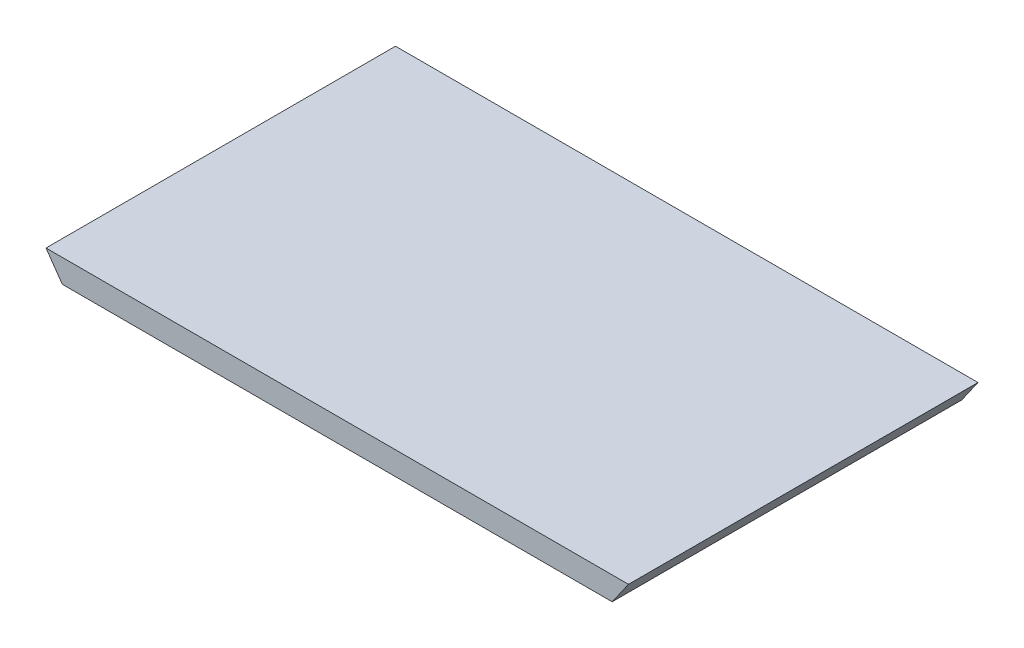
ISO-10303-21;
HEADER;
FILE_DESCRIPTION(('STEP AP214'),'2;1');
FILE_NAME('part.step','',(''),(''),'','','');
FILE_SCHEMA(('AUTOMOTIVE_DESIGN { 1 0 10303 214 1 1 1 1 }'));
ENDSEC;
DATA;
#1=APPLICATION_CONTEXT('core data for automotive mechanical design processes');
#2=APPLICATION_PROTOCOL_DEFINITION('international standard','automotive_design',2000,#1);
#3=PRODUCT_CONTEXT('',#1,'mechanical');
#4=PRODUCT('Part','Part','',(#3));
#5=PRODUCT_RELATED_PRODUCT_CATEGORY('part','',(#4));
#6=PRODUCT_DEFINITION_FORMATION('','',#4);
#7=PRODUCT_DEFINITION_CONTEXT('part definition',#1,'design');
#8=PRODUCT_DEFINITION('design','',#6,#7);
#9=PRODUCT_DEFINITION_SHAPE('','',#8);
#10=(LENGTH_UNIT() NAMED_UNIT(*) SI_UNIT(.MILLI.,.METRE.));
#11=(NAMED_UNIT(*) PLANE_ANGLE_UNIT() SI_UNIT($,.RADIAN.));
#12=(NAMED_UNIT(*) SI_UNIT($,.STERADIAN.) SOLID_ANGLE_UNIT());
#13=UNCERTAINTY_MEASURE_WITH_UNIT(LENGTH_MEASURE(1.E-05),#10,'distance_accuracy_value','');
#14=(GEOMETRIC_REPRESENTATION_CONTEXT(3) GLOBAL_UNCERTAINTY_ASSIGNED_CONTEXT((#13)) GLOBAL_UNIT_ASSIGNED_CONTEXT((#10,
#11,#12)) REPRESENTATION_CONTEXT('',''));
#15=CARTESIAN_POINT('',(0.,0.,0.));
#16=DIRECTION('',(0.,0.,1.));
#17=DIRECTION('',(1.,0.,0.));
#18=AXIS2_PLACEMENT_3D('',#15,#16,#17);
#19=CARTESIAN_POINT('',(-250.,10.,-150.));
#20=DIRECTION('',(0.,0.,1.));
#21=DIRECTION('',(1.,0.,0.));
#22=AXIS2_PLACEMENT_3D('',#19,#20,#21);
#23=PLANE('',#22);
#24=DIRECTION('',(-1.,0.,0.));
#25=VECTOR('',#24,1.);
#26=CARTESIAN_POINT('',(-250.,-10.,-150.));
#27=LINE('',#26,#25);
#28=CARTESIAN_POINT('',(235.995849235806,-10.,-150.));
#29=VERTEX_POINT('',#28);
#30=CARTESIAN_POINT('',(-235.995849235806,-10.,-150.));
#31=VERTEX_POINT('',#30);
#32=EDGE_CURVE('E89',#29,#31,#27,.T.);
#33=ORIENTED_EDGE('',*,*,#32,.T.);
#34=DIRECTION('',(0.573576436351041,-0.819152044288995,0.));
#35=VECTOR('',#34,1.);
#36=CARTESIAN_POINT('',(-250.,10.,-150.));
#37=LINE('',#36,#35);
#38=CARTESIAN_POINT('',(-250.,10.,-150.));
#39=VERTEX_POINT('',#38);
#40=EDGE_CURVE('E49',#39,#31,#37,.T.);
#41=ORIENTED_EDGE('',*,*,#40,.F.);
#42=DIRECTION('',(-1.,0.,0.));
#43=VECTOR('',#42,1.);
#44=CARTESIAN_POINT('',(-250.,10.,-150.));
#45=LINE('',#44,#43);
#46=CARTESIAN_POINT('',(250.,10.,-150.));
#47=VERTEX_POINT('',#46);
#48=EDGE_CURVE('E91',#47,#39,#45,.T.);
#49=ORIENTED_EDGE('',*,*,#48,.F.);
#50=DIRECTION('',(0.573576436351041,0.819152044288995,0.));
#51=VECTOR('',#50,1.);
#52=CARTESIAN_POINT('',(250.,10.,-150.));
#53=LINE('',#52,#51);
#54=EDGE_CURVE('E93',#29,#47,#53,.T.);
#55=ORIENTED_EDGE('',*,*,#54,.F.);
#56=EDGE_LOOP('',(#33,#41,#49,#55));
#57=FACE_BOUND('',#56,.T.);
#58=ADVANCED_FACE('F33',(#57),#23,.F.);
#59=CARTESIAN_POINT('',(-250.,10.,150.));
#60=DIRECTION('',(0.,0.,-1.));
#61=DIRECTION('',(-1.,0.,0.));
#62=AXIS2_PLACEMENT_3D('',#59,#60,#61);
#63=PLANE('',#62);
#64=DIRECTION('',(1.,0.,0.));
#65=VECTOR('',#64,1.);
#66=CARTESIAN_POINT('',(-250.,10.,150.));
#67=LINE('',#66,#65);
#68=CARTESIAN_POINT('',(-250.,10.,150.));
#69=VERTEX_POINT('',#68);
#70=CARTESIAN_POINT('',(250.,10.,150.));
#71=VERTEX_POINT('',#70);
#72=EDGE_CURVE('E11',#69,#71,#67,.T.);
#73=ORIENTED_EDGE('',*,*,#72,.F.);
#74=DIRECTION('',(-0.573576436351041,0.819152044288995,0.));
#75=VECTOR('',#74,1.);
#76=CARTESIAN_POINT('',(-250.,10.,150.));
#77=LINE('',#76,#75);
#78=CARTESIAN_POINT('',(-235.995849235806,-10.,150.));
#79=VERTEX_POINT('',#78);
#80=EDGE_CURVE('E75',#79,#69,#77,.T.);
#81=ORIENTED_EDGE('',*,*,#80,.F.);
#82=DIRECTION('',(1.,0.,0.));
#83=VECTOR('',#82,1.);
#84=CARTESIAN_POINT('',(-250.,-10.,150.));
#85=LINE('',#84,#83);
#86=CARTESIAN_POINT('',(235.995849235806,-10.,150.));
#87=VERTEX_POINT('',#86);
#88=EDGE_CURVE('E36',#79,#87,#85,.T.);
#89=ORIENTED_EDGE('',*,*,#88,.T.);
#90=DIRECTION('',(-0.573576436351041,-0.819152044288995,0.));
#91=VECTOR('',#90,1.);
#92=CARTESIAN_POINT('',(250.,10.,150.));
#93=LINE('',#92,#91);
#94=EDGE_CURVE('E80',#71,#87,#93,.T.);
#95=ORIENTED_EDGE('',*,*,#94,.F.);
#96=EDGE_LOOP('',(#73,#81,#89,#95));
#97=FACE_BOUND('',#96,.T.);
#98=ADVANCED_FACE('F83',(#97),#63,.F.);
#99=CARTESIAN_POINT('',(0.,10.,0.));
#100=DIRECTION('',(0.,-1.,0.));
#101=DIRECTION('',(0.,0.,-1.));
#102=AXIS2_PLACEMENT_3D('',#99,#100,#101);
#103=PLANE('',#102);
#104=DIRECTION('',(0.,0.,-1.));
#105=VECTOR('',#104,1.);
#106=CARTESIAN_POINT('',(250.,10.,150.));
#107=LINE('',#106,#105);
#108=EDGE_CURVE('E88',#71,#47,#107,.T.);
#109=ORIENTED_EDGE('',*,*,#108,.T.);
#110=ORIENTED_EDGE('',*,*,#48,.T.);
#111=DIRECTION('',(0.,0.,1.));
#112=VECTOR('',#111,1.);
#113=CARTESIAN_POINT('',(-250.,10.,150.));
#114=LINE('',#113,#112);
#115=EDGE_CURVE('E41',#39,#69,#114,.T.);
#116=ORIENTED_EDGE('',*,*,#115,.T.);
#117=ORIENTED_EDGE('',*,*,#72,.T.);
#118=EDGE_LOOP('',(#109,#110,#116,#117));
#119=FACE_BOUND('',#118,.T.);
#120=ADVANCED_FACE('F106',(#119),#103,.F.);
#121=CARTESIAN_POINT('',(0.,-10.,0.));
#122=DIRECTION('',(0.,-1.,0.));
#123=DIRECTION('',(0.,0.,-1.));
#124=AXIS2_PLACEMENT_3D('',#121,#122,#123);
#125=PLANE('',#124);
#126=DIRECTION('',(0.,0.,1.));
#127=VECTOR('',#126,1.);
#128=CARTESIAN_POINT('',(-235.995849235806,-10.,-150.001));
#129=LINE('',#128,#127);
#130=EDGE_CURVE('E73',#31,#79,#129,.T.);
#131=ORIENTED_EDGE('',*,*,#130,.F.);
#132=ORIENTED_EDGE('',*,*,#32,.F.);
#133=DIRECTION('',(0.,0.,1.));
#134=VECTOR('',#133,1.);
#135=CARTESIAN_POINT('',(235.995849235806,-10.,-150.001));
#136=LINE('',#135,#134);
#137=EDGE_CURVE('E87',#29,#87,#136,.T.);
#138=ORIENTED_EDGE('',*,*,#137,.T.);
#139=ORIENTED_EDGE('',*,*,#88,.F.);
#140=EDGE_LOOP('',(#131,#132,#138,#139));
#141=FACE_BOUND('',#140,.T.);
#142=ADVANCED_FACE('F86',(#141),#125,.T.);
#143=CARTESIAN_POINT('',(250.,10.,-150.001));
#144=DIRECTION('',(-0.819152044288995,0.573576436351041,0.));
#145=DIRECTION('',(-0.573576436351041,-0.819152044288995,0.));
#146=AXIS2_PLACEMENT_3D('',#143,#144,#145);
#147=PLANE('',#146);
#148=ORIENTED_EDGE('',*,*,#54,.T.);
#149=ORIENTED_EDGE('',*,*,#108,.F.);
#150=ORIENTED_EDGE('',*,*,#94,.T.);
#151=ORIENTED_EDGE('',*,*,#137,.F.);
#152=EDGE_LOOP('',(#148,#149,#150,#151));
#153=FACE_BOUND('',#152,.T.);
#154=ADVANCED_FACE('F104',(#153),#147,.F.);
#155=CARTESIAN_POINT('',(-250.,10.,-150.001));
#156=DIRECTION('',(0.819152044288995,0.573576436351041,0.));
#157=DIRECTION('',(-0.573576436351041,0.819152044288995,0.));
#158=AXIS2_PLACEMENT_3D('',#155,#156,#157);
#159=PLANE('',#158);
#160=ORIENTED_EDGE('',*,*,#40,.T.);
#161=ORIENTED_EDGE('',*,*,#130,.T.);
#162=ORIENTED_EDGE('',*,*,#80,.T.);
#163=ORIENTED_EDGE('',*,*,#115,.F.);
#164=EDGE_LOOP('',(#160,#161,#162,#163));
#165=FACE_BOUND('',#164,.T.);
#166=ADVANCED_FACE('F74',(#165),#159,.F.);
#167=CLOSED_SHELL('',(#58,#98,#120,#142,#154,#166));
#168=MANIFOLD_SOLID_BREP('B2',#167);
#169=ADVANCED_BREP_SHAPE_REPRESENTATION('',(#18,#168),#14);
#170=SHAPE_DEFINITION_REPRESENTATION(#9,#169);
ENDSEC;
END-ISO-10303-21;
